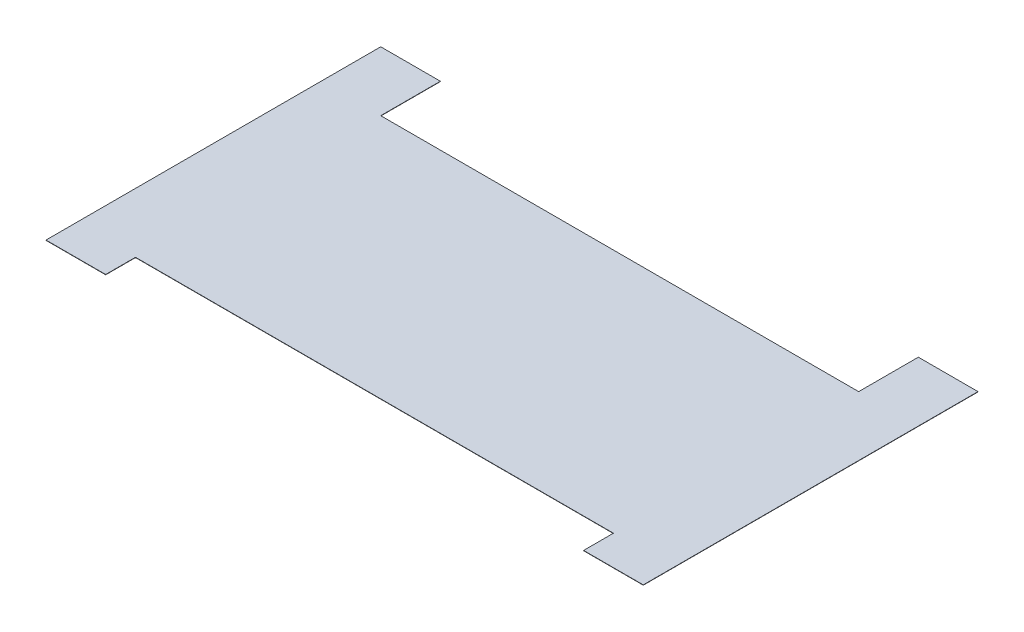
from build123d import *

# Parameters (mm, degrees)
BOSS_EXTRUDE1_DEPTH = 0.05


with BuildPart() as part:
    # Sketch1 → Boss-Extrude1 (new body)
    with BuildSketch(Plane(origin=(0, 0, 0), x_dir=(1, 0, 0), z_dir=(0, 1, 0))):
        Polygon((0, 0), (0, 56.1), (10, 56.1), (10, 46.1), (90.1, 46.1), (90.1, 56.1), (100.1, 56.1), (100.1, 0), (90.1, 0), (90.1, 5), (10, 5), (10, 0), align=None)
    extrude(amount=BOSS_EXTRUDE1_DEPTH)


solid = part.part
